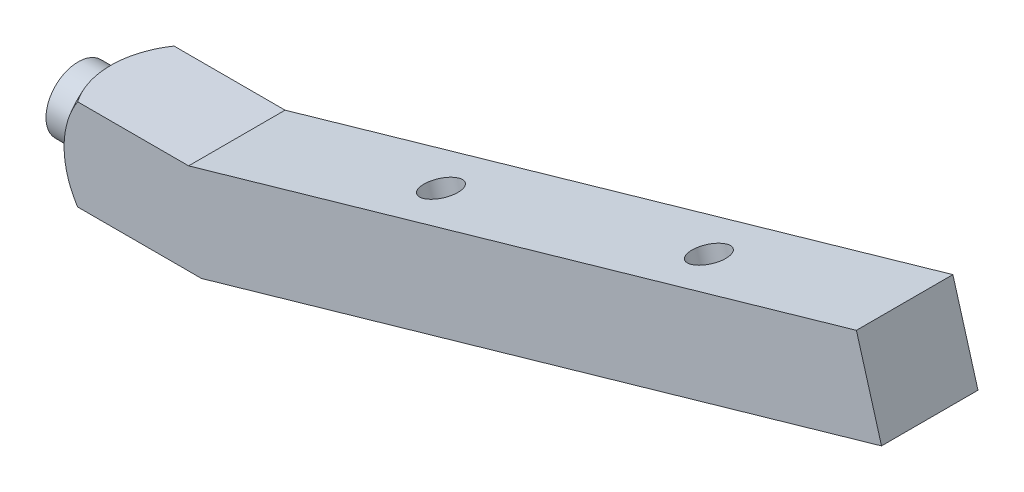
from build123d import *

# Parameters (mm, degrees)
EXTRUSION1_DEPTH      = 18
ESQUISSE3_R           = 6
EXTRUSION2_DEPTH      = 5
TROU_TARAUD_M81_D     = 6.8
TROU_TARAUD_M81_DEPTH = 28
TROU_TARAUD_M81_TIP   = 2.042926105
D_GAGEMENT_M61_D      = 6.6


with BuildPart() as part:
    # Esquisse1 → Extrusion1 (new body)
    with BuildSketch(Plane.XY):
        Polygon((0, 0), (28, 0), (154.886543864, 36.384130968), (150.200708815, 52.725579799), (25.61080581, 17), (0, 17), align=None)
    extrude(amount=EXTRUSION1_DEPTH)

    # Esquisse2 → Enl_vement de mati_re-R_volution3 (revolve, cut)
    with BuildSketch(Plane.XY.offset(9), mode=Mode.PRIVATE) as enl_vement_de_mati_re_r_volution3_sk:
        with BuildLine():
            Line((17.970562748, 26.5), (-6.071444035, 26.5))
            Line((-6.071444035, 26.5), (-6.071444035, 8.5))
            Line((-6.071444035, 8.5), (0, 8.5))
            Line((0, 8.5), (1, 8.5))
            Line((1, 8.5), (1, 14.5))
            ThreePointArc((1, 14.5), (7.578257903, 23.196938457), (17.970562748, 26.5))
        make_face()
    revolve(enl_vement_de_mati_re_r_volution3_sk.sketch.rotate(Axis((0, 8.5, 9), (1, 0, 0)), 46.636577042), axis=Axis((0, 8.5, 9), (1, 0, 0)), mode=Mode.SUBTRACT)

    # Esquisse3 → Extrusion2 (add)
    with BuildSketch(Plane.ZY.offset(-1)):
        with Locations((9, 8.5)):
            Circle(ESQUISSE3_R)
    extrude(amount=EXTRUSION2_DEPTH)

    # Trou taraud_ M81
    with Locations(Plane.ZY.offset(4)):
        with Locations((9, 8.5)):
            Hole(TROU_TARAUD_M81_D / 2, depth=TROU_TARAUD_M81_DEPTH)
            with Locations((0, 0, -(TROU_TARAUD_M81_DEPTH + TROU_TARAUD_M81_TIP / 2))):  # 118° drill point
                Cone(0, TROU_TARAUD_M81_D / 2, TROU_TARAUD_M81_TIP, mode=Mode.SUBTRACT)

    # D_gagement M61 (through all)
    with Locations(Plane(origin=(-2.558508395, 8.922579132, 0), x_dir=(-0.9612616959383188, -0.27563735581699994, 0), z_dir=(-0.27563735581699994, 0.9612616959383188, 0))):
        with Locations((-68.915327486, 9), (-120.915327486, 9)):
            Hole(D_GAGEMENT_M61_D / 2)


solid = part.part
